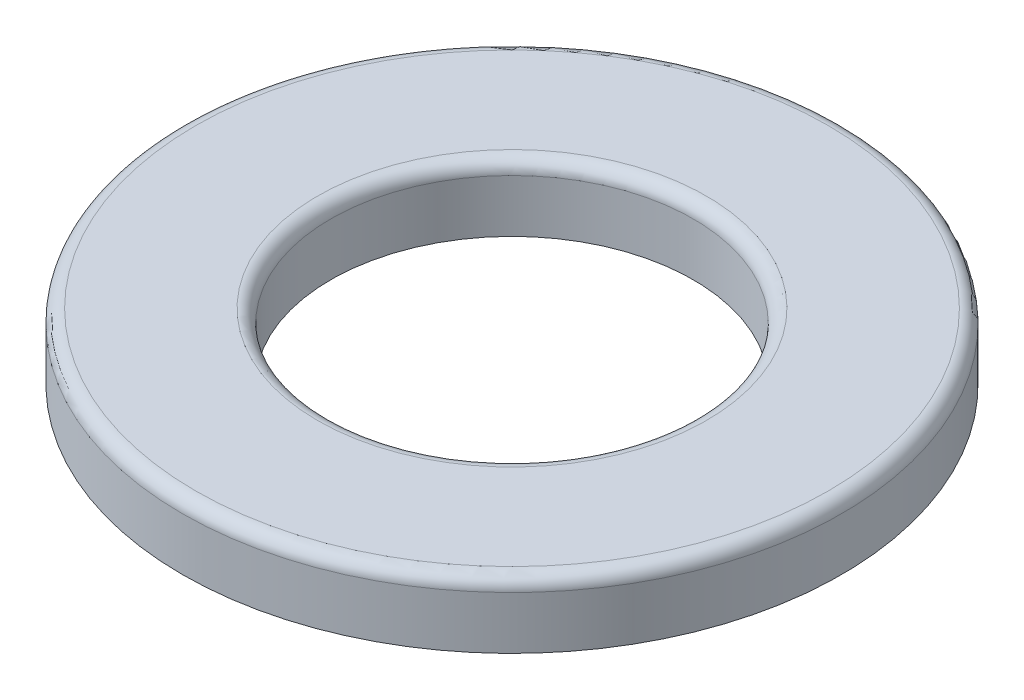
from build123d import *

# Parameters (mm, degrees)
SKETCH_1_R      = 5
SKETCH_1_R_2    = 2.75
EXTRUDE_1_DEPTH = 0.5
FILLET_1_R      = 0.2


with BuildPart() as part:
    # Sketch 1 → Extrude 1 (new, symmetric)
    with BuildSketch(Plane(origin=(0, 0, 0), x_dir=(1, 0, 0), z_dir=(0, 1, 0))):
        with Locations(Location((0, 0, 0), (0, 0, 270))):
            Circle(SKETCH_1_R)
        with Locations(Location((0, 0, 0), (0, 0, 270))):
            Circle(SKETCH_1_R_2, mode=Mode.SUBTRACT)
    extrude(amount=EXTRUDE_1_DEPTH, both=True)

    # Fillet 1
    fillet_1_edges = [part.edges().sort_by_distance(p)[0] for p in [
        (0, 0.5, -5),
        (0, 0.5, -2.75),
    ]]
    fillet(fillet_1_edges, radius=FILLET_1_R)


solid = part.part
